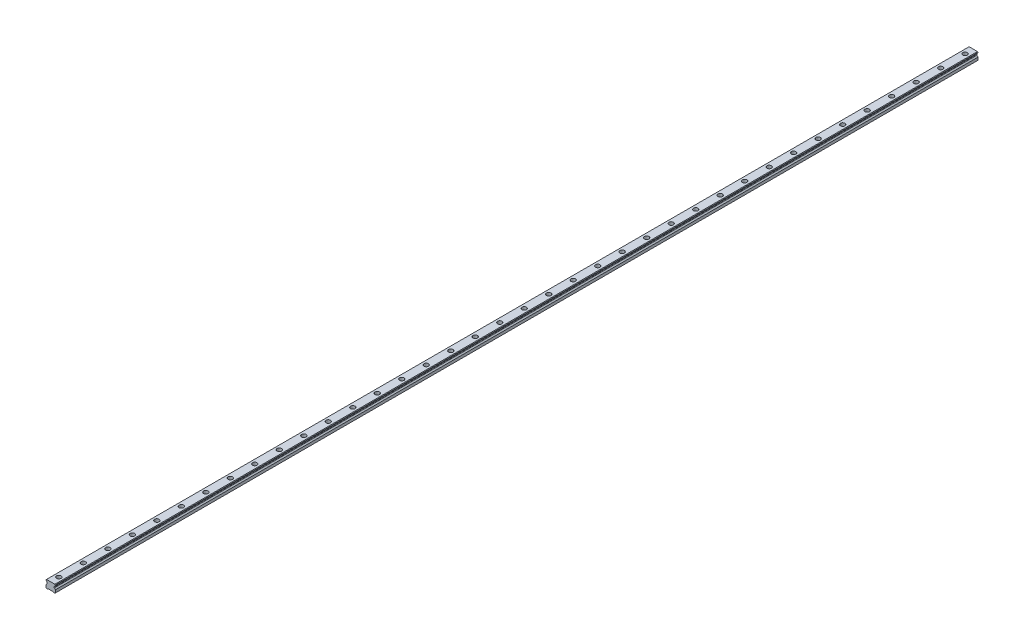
from build123d import *

# Parameters (mm, degrees)
SKETCH1_W           = 23
SKETCH1_H           = 19.2
BOSS_EXTRUDE1_DEPTH = 1130
CUT_EXTRUDE1_DEPTH  = 2261.110813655
CHAMFER1_SIZE       = 1.25
FILLET1_R           = 1.25
CUT_EXTRUDE2_DEPTH  = 2261.110813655
SKETCH4_R           = 5.5
SKETCH4_R_2         = 3.5
CUT_EXTRUDE3_DEPTH  = 9
SKETCH4_2_R         = 3.5
CUT_EXTRUDE4_DEPTH  = 1131.221611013
LPATTERN1_COUNT     = 38
LPATTERN1_PITCH     = 60


with BuildPart() as part:
    # Sketch1 → Boss-Extrude1 (new, symmetric)
    with BuildSketch(Plane.XY):
        with Locations((0, 9.6)):
            Rectangle(SKETCH1_W, SKETCH1_H)
    extrude(amount=BOSS_EXTRUDE1_DEPTH, both=True)

    # Sketch2 → Cut-Extrude1 (cut, through all)
    with BuildSketch(Plane.XY.offset(1130)):
        Polygon((-11.5, 16.7), (-11.5, 7.95), (-8.583333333, 10.866666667), (-8.583333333, 13.783333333), align=None)
        Polygon((8.583333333, 13.783333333), (11.5, 16.7), (11.5, 7.95), (8.583333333, 10.866666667), align=None)
    extrude(amount=-CUT_EXTRUDE1_DEPTH, mode=Mode.SUBTRACT)

    # Chamfer1
    chamfer1_edges = [part.edges().sort_by_distance(p)[0] for p in [
        (-11.5, 19.2, 0),
        (11.5, 19.2, 0),
        (11.5, 0, 0),
        (-11.5, 0, 0),
    ]]
    chamfer(chamfer1_edges, length=CHAMFER1_SIZE)

    # Fillet1
    fillet1_edges = [part.edges().sort_by_distance(p)[0] for p in [
        (-8.583333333, 13.783333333, 0),
        (-8.583333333, 10.866666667, 0),
        (8.583333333, 10.866666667, 0),
        (8.583333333, 13.783333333, 0),
    ]]
    fillet(fillet1_edges, radius=FILLET1_R)

    # Sketch3 → Cut-Extrude2 (cut, through all)
    with BuildSketch(Plane.XY.offset(1130)):
        Polygon((-7, 0), (-5.75, 1.25), (5.75, 1.25), (7, 0), align=None)
    extrude(amount=-CUT_EXTRUDE2_DEPTH, mode=Mode.SUBTRACT)

    # Sketch4 → Cut-Extrude3 (cut)
    with BuildSketch(Plane(origin=(0, 19.2, 0), x_dir=(1, 0, 0), z_dir=(0, 1, 0))):
        with Locations(Location((0, -1110, 0), (0, 0, 270))):
            Circle(SKETCH4_R)
        with Locations(Location((0, -1110, 0), (0, 0, 270))):
            Circle(SKETCH4_R_2, mode=Mode.SUBTRACT)
    cut_extrude3 = extrude(amount=-CUT_EXTRUDE3_DEPTH, mode=Mode.SUBTRACT)

    # Sketch4_2 → Cut-Extrude4 (cut, through all)
    with BuildSketch(Plane(origin=(0, 19.2, 0), x_dir=(1, 0, 0), z_dir=(0, 1, 0))):
        with Locations(Location((0, -1110, 0), (0, 0, 270))):
            Circle(SKETCH4_2_R)
    cut_extrude4 = extrude(amount=-CUT_EXTRUDE4_DEPTH, mode=Mode.SUBTRACT)

    # LPattern1: Cut-Extrude3, Cut-Extrude4 ×38
    with Locations(*[(0, 0, -i * LPATTERN1_PITCH) for i in range(1, LPATTERN1_COUNT)]):
        add(cut_extrude3, mode=Mode.SUBTRACT)
        add(cut_extrude4, mode=Mode.SUBTRACT)


solid = part.part
